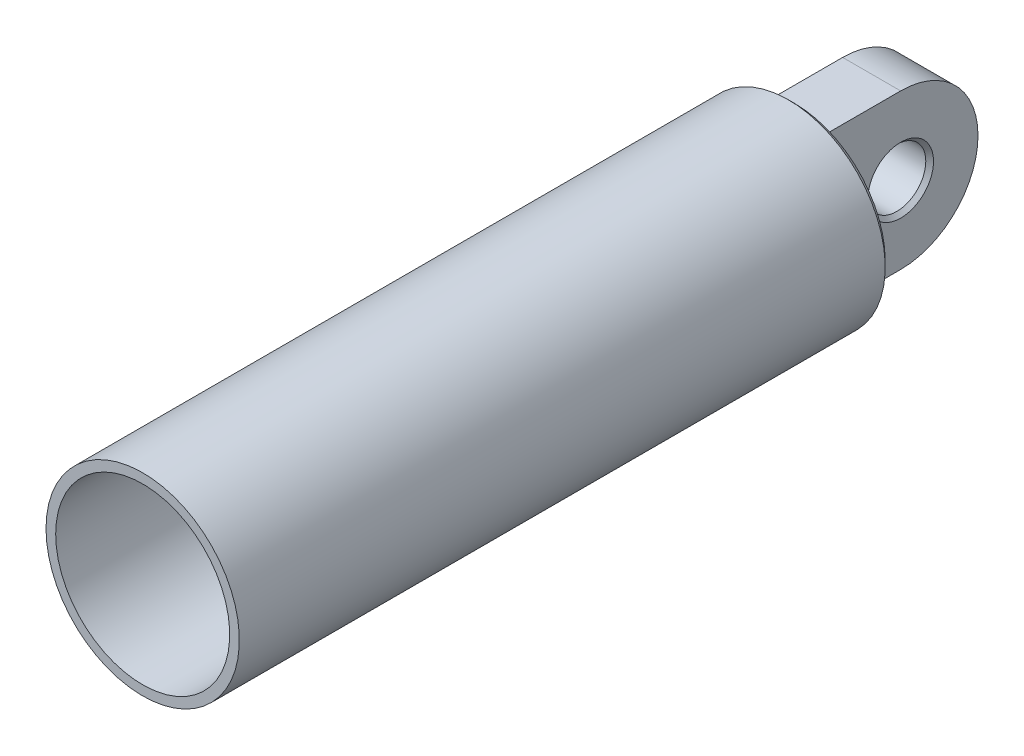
ISO-10303-21;
HEADER;
FILE_DESCRIPTION(('STEP AP214'),'2;1');
FILE_NAME('part.step','',(''),(''),'','','');
FILE_SCHEMA(('AUTOMOTIVE_DESIGN { 1 0 10303 214 1 1 1 1 }'));
ENDSEC;
DATA;
#1=APPLICATION_CONTEXT('core data for automotive mechanical design processes');
#2=APPLICATION_PROTOCOL_DEFINITION('international standard','automotive_design',2000,#1);
#3=PRODUCT_CONTEXT('',#1,'mechanical');
#4=PRODUCT('Part','Part','',(#3));
#5=PRODUCT_RELATED_PRODUCT_CATEGORY('part','',(#4));
#6=PRODUCT_DEFINITION_FORMATION('','',#4);
#7=PRODUCT_DEFINITION_CONTEXT('part definition',#1,'design');
#8=PRODUCT_DEFINITION('design','',#6,#7);
#9=PRODUCT_DEFINITION_SHAPE('','',#8);
#10=(LENGTH_UNIT() NAMED_UNIT(*) SI_UNIT(.MILLI.,.METRE.));
#11=(NAMED_UNIT(*) PLANE_ANGLE_UNIT() SI_UNIT($,.RADIAN.));
#12=(NAMED_UNIT(*) SI_UNIT($,.STERADIAN.) SOLID_ANGLE_UNIT());
#13=UNCERTAINTY_MEASURE_WITH_UNIT(LENGTH_MEASURE(1.E-05),#10,'distance_accuracy_value','');
#14=(GEOMETRIC_REPRESENTATION_CONTEXT(3) GLOBAL_UNCERTAINTY_ASSIGNED_CONTEXT((#13)) GLOBAL_UNIT_ASSIGNED_CONTEXT((#10,
#11,#12)) REPRESENTATION_CONTEXT('',''));
#15=CARTESIAN_POINT('',(0.,0.,0.));
#16=DIRECTION('',(0.,0.,1.));
#17=DIRECTION('',(1.,0.,0.));
#18=AXIS2_PLACEMENT_3D('',#15,#16,#17);
#19=CARTESIAN_POINT('',(0.,0.,-9.99999999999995));
#20=DIRECTION('',(0.,0.,-1.));
#21=DIRECTION('',(-1.,0.,0.));
#22=AXIS2_PLACEMENT_3D('',#19,#20,#21);
#23=PLANE('',#22);
#24=CARTESIAN_POINT('',(0.,0.,-9.99999999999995));
#25=DIRECTION('',(0.,0.,-1.));
#26=DIRECTION('',(-1.,0.,0.));
#27=AXIS2_PLACEMENT_3D('',#24,#25,#26);
#28=CIRCLE('',#27,47.);
#29=CARTESIAN_POINT('',(-47.,0.,-9.99999999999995));
#30=VERTEX_POINT('',#29);
#31=EDGE_CURVE('E130',#30,#30,#28,.T.);
#32=ORIENTED_EDGE('',*,*,#31,.T.);
#33=EDGE_LOOP('',(#32));
#34=FACE_BOUND('',#33,.T.);
#35=DIRECTION('',(-1.,0.,0.));
#36=VECTOR('',#35,1.);
#37=CARTESIAN_POINT('',(14.9999999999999,-40.,-10.0000000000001));
#38=LINE('',#37,#36);
#39=CARTESIAN_POINT('',(14.9999999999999,-40.,-10.0000000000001));
#40=VERTEX_POINT('',#39);
#41=CARTESIAN_POINT('',(-15.,-40.,-9.99999999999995));
#42=VERTEX_POINT('',#41);
#43=EDGE_CURVE('E91',#40,#42,#38,.T.);
#44=ORIENTED_EDGE('',*,*,#43,.F.);
#45=DIRECTION('',(0.,-1.,0.));
#46=VECTOR('',#45,1.);
#47=CARTESIAN_POINT('',(14.9999999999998,40.,-9.99999999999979));
#48=LINE('',#47,#46);
#49=CARTESIAN_POINT('',(14.9999999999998,40.,-9.99999999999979));
#50=VERTEX_POINT('',#49);
#51=EDGE_CURVE('E101',#50,#40,#48,.T.);
#52=ORIENTED_EDGE('',*,*,#51,.F.);
#53=DIRECTION('',(1.,0.,0.));
#54=VECTOR('',#53,1.);
#55=CARTESIAN_POINT('',(14.9999999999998,40.,-9.99999999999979));
#56=LINE('',#55,#54);
#57=CARTESIAN_POINT('',(-15.0000000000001,40.,-9.99999999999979));
#58=VERTEX_POINT('',#57);
#59=EDGE_CURVE('E113',#58,#50,#56,.T.);
#60=ORIENTED_EDGE('',*,*,#59,.F.);
#61=DIRECTION('',(0.,1.,0.));
#62=VECTOR('',#61,1.);
#63=CARTESIAN_POINT('',(-15.0000000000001,40.,-9.99999999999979));
#64=LINE('',#63,#62);
#65=EDGE_CURVE('E111',#42,#58,#64,.T.);
#66=ORIENTED_EDGE('',*,*,#65,.F.);
#67=EDGE_LOOP('',(#44,#52,#60,#66));
#68=FACE_BOUND('',#67,.T.);
#69=ADVANCED_FACE('F42',(#34,#68),#23,.T.);
#70=CARTESIAN_POINT('',(0.,0.,327.));
#71=DIRECTION('',(0.,0.,1.));
#72=DIRECTION('',(1.,0.,0.));
#73=AXIS2_PLACEMENT_3D('',#70,#71,#72);
#74=PLANE('',#73);
#75=CARTESIAN_POINT('',(0.,0.,327.));
#76=DIRECTION('',(0.,0.,1.));
#77=DIRECTION('',(1.,0.,0.));
#78=AXIS2_PLACEMENT_3D('',#75,#76,#77);
#79=CIRCLE('',#78,50.);
#80=CARTESIAN_POINT('',(-50.,0.,327.));
#81=VERTEX_POINT('',#80);
#82=EDGE_CURVE('E127',#81,#81,#79,.T.);
#83=ORIENTED_EDGE('',*,*,#82,.T.);
#84=EDGE_LOOP('',(#83));
#85=FACE_BOUND('',#84,.T.);
#86=CARTESIAN_POINT('',(0.,0.,327.));
#87=DIRECTION('',(0.,0.,1.));
#88=DIRECTION('',(1.,0.,0.));
#89=AXIS2_PLACEMENT_3D('',#86,#87,#88);
#90=CIRCLE('',#89,45.);
#91=CARTESIAN_POINT('',(-45.,0.,327.));
#92=VERTEX_POINT('',#91);
#93=EDGE_CURVE('E124',#92,#92,#90,.T.);
#94=ORIENTED_EDGE('',*,*,#93,.F.);
#95=EDGE_LOOP('',(#94));
#96=FACE_BOUND('',#95,.T.);
#97=ADVANCED_FACE('F186',(#85,#96),#74,.T.);
#98=CARTESIAN_POINT('',(0.,0.,327.));
#99=DIRECTION('',(0.,0.,-1.));
#100=DIRECTION('',(-1.,0.,0.));
#101=AXIS2_PLACEMENT_3D('',#98,#99,#100);
#102=CYLINDRICAL_SURFACE('',#101,50.);
#103=CARTESIAN_POINT('',(0.,0.,-7.00000000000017));
#104=DIRECTION('',(0.,0.,-1.));
#105=DIRECTION('',(-1.,0.,0.));
#106=AXIS2_PLACEMENT_3D('',#103,#104,#105);
#107=CIRCLE('',#106,50.);
#108=CARTESIAN_POINT('',(-50.,0.,-7.00000000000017));
#109=VERTEX_POINT('',#108);
#110=EDGE_CURVE('E133',#109,#109,#107,.F.);
#111=CARTESIAN_POINT('',(-50.,0.,-7.00000000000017));
#112=CARTESIAN_POINT('',(-50.,0.,-3.52083333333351));
#113=CARTESIAN_POINT('',(-50.,0.,-0.0416666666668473));
#114=CARTESIAN_POINT('',(-50.,0.,6.9166666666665));
#115=CARTESIAN_POINT('',(-50.,0.,10.3958333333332));
#116=CARTESIAN_POINT('',(-50.,0.,17.3541666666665));
#117=CARTESIAN_POINT('',(-50.,0.,20.8333333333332));
#118=CARTESIAN_POINT('',(-50.,0.,27.7916666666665));
#119=CARTESIAN_POINT('',(-50.,0.,31.2708333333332));
#120=CARTESIAN_POINT('',(-50.,0.,38.2291666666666));
#121=CARTESIAN_POINT('',(-50.,0.,41.7083333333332));
#122=CARTESIAN_POINT('',(-50.,0.,48.6666666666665));
#123=CARTESIAN_POINT('',(-50.,0.,52.1458333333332));
#124=CARTESIAN_POINT('',(-50.,0.,59.1041666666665));
#125=CARTESIAN_POINT('',(-50.,0.,62.5833333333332));
#126=CARTESIAN_POINT('',(-50.,0.,69.5416666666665));
#127=CARTESIAN_POINT('',(-50.,0.,73.0208333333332));
#128=CARTESIAN_POINT('',(-50.,0.,79.9791666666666));
#129=CARTESIAN_POINT('',(-50.,0.,83.4583333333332));
#130=CARTESIAN_POINT('',(-50.,0.,90.4166666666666));
#131=CARTESIAN_POINT('',(-50.,0.,93.8958333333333));
#132=CARTESIAN_POINT('',(-50.,0.,100.854166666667));
#133=CARTESIAN_POINT('',(-50.,0.,104.333333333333));
#134=CARTESIAN_POINT('',(-50.,0.,111.291666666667));
#135=CARTESIAN_POINT('',(-50.,0.,114.770833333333));
#136=CARTESIAN_POINT('',(-50.,0.,121.729166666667));
#137=CARTESIAN_POINT('',(-50.,0.,125.208333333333));
#138=CARTESIAN_POINT('',(-50.,0.,132.166666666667));
#139=CARTESIAN_POINT('',(-50.,0.,135.645833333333));
#140=CARTESIAN_POINT('',(-50.,0.,142.604166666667));
#141=CARTESIAN_POINT('',(-50.,0.,146.083333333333));
#142=CARTESIAN_POINT('',(-50.,0.,153.041666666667));
#143=CARTESIAN_POINT('',(-50.,0.,156.520833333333));
#144=CARTESIAN_POINT('',(-50.,0.,163.479166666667));
#145=CARTESIAN_POINT('',(-50.,0.,166.958333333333));
#146=CARTESIAN_POINT('',(-50.,0.,173.916666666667));
#147=CARTESIAN_POINT('',(-50.,0.,177.395833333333));
#148=CARTESIAN_POINT('',(-50.,0.,184.354166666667));
#149=CARTESIAN_POINT('',(-50.,0.,187.833333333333));
#150=CARTESIAN_POINT('',(-50.,0.,194.791666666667));
#151=CARTESIAN_POINT('',(-50.,0.,198.270833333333));
#152=CARTESIAN_POINT('',(-50.,0.,205.229166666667));
#153=CARTESIAN_POINT('',(-50.,0.,208.708333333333));
#154=CARTESIAN_POINT('',(-50.,0.,215.666666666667));
#155=CARTESIAN_POINT('',(-50.,0.,219.145833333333));
#156=CARTESIAN_POINT('',(-50.,0.,226.104166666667));
#157=CARTESIAN_POINT('',(-50.,0.,229.583333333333));
#158=CARTESIAN_POINT('',(-50.,0.,236.541666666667));
#159=CARTESIAN_POINT('',(-50.,0.,240.020833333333));
#160=CARTESIAN_POINT('',(-50.,0.,246.979166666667));
#161=CARTESIAN_POINT('',(-50.,0.,250.458333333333));
#162=CARTESIAN_POINT('',(-50.,0.,257.416666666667));
#163=CARTESIAN_POINT('',(-50.,0.,260.895833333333));
#164=CARTESIAN_POINT('',(-50.,0.,267.854166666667));
#165=CARTESIAN_POINT('',(-50.,0.,271.333333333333));
#166=CARTESIAN_POINT('',(-50.,0.,278.291666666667));
#167=CARTESIAN_POINT('',(-50.,0.,281.770833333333));
#168=CARTESIAN_POINT('',(-50.,0.,288.729166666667));
#169=CARTESIAN_POINT('',(-50.,0.,292.208333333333));
#170=CARTESIAN_POINT('',(-50.,0.,299.166666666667));
#171=CARTESIAN_POINT('',(-50.,0.,302.645833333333));
#172=CARTESIAN_POINT('',(-50.,0.,309.604166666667));
#173=CARTESIAN_POINT('',(-50.,0.,313.083333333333));
#174=CARTESIAN_POINT('',(-50.,0.,320.041666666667));
#175=CARTESIAN_POINT('',(-50.,0.,323.520833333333));
#176=CARTESIAN_POINT('',(-50.,0.,327.));
#177=B_SPLINE_CURVE_WITH_KNOTS('',3,(#111,#112,#113,#114,#115,#116,#117,#118,#119,#120,#121,
#122,#123,#124,#125,#126,#127,#128,#129,#130,#131,#132,#133,#134,#135,#136,#137,#138,#139,#140,
#141,#142,#143,#144,#145,#146,#147,#148,#149,#150,#151,#152,#153,#154,#155,#156,#157,#158,#159,
#160,#161,#162,#163,#164,#165,#166,#167,#168,#169,#170,#171,#172,#173,#174,#175,#176),
.UNSPECIFIED.,.F.,.F.,(4,2,2,2,2,2,2,2,2,2,2,2,2,2,2,2,2,2,2,2,2,2,2,2,2,2,2,2,2,2,2,2,4),(0.,
10.4375,20.875,31.3125,41.7500000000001,52.1875000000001,62.625,73.0625,83.5000000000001,
93.9375000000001,104.375,114.8125,125.25,135.6875,146.125,156.5625,167.,177.4375,187.875,
198.3125,208.75,219.1875,229.625,240.0625,250.5,260.9375,271.375,281.8125,292.25,302.6875,
313.125,323.5625,334.),.UNSPECIFIED.);
#178=EDGE_CURVE('BSEAM44',#109,#81,#177,.T.);
#179=ORIENTED_EDGE('',*,*,#110,.T.);
#180=ORIENTED_EDGE('',*,*,#82,.F.);
#181=ORIENTED_EDGE('',*,*,#178,.T.);
#182=ORIENTED_EDGE('',*,*,#178,.F.);
#183=EDGE_LOOP('',(#179,#181,#180,#182));
#184=FACE_BOUND('',#183,.T.);
#185=ADVANCED_FACE('F44',(#184),#102,.T.);
#186=CARTESIAN_POINT('',(0.,0.,327.));
#187=DIRECTION('',(0.,0.,-1.));
#188=DIRECTION('',(-1.,0.,0.));
#189=AXIS2_PLACEMENT_3D('',#186,#187,#188);
#190=CYLINDRICAL_SURFACE('',#189,45.);
#191=CARTESIAN_POINT('',(0.,0.,0.));
#192=DIRECTION('',(0.,0.,1.));
#193=DIRECTION('',(1.,0.,0.));
#194=AXIS2_PLACEMENT_3D('',#191,#192,#193);
#195=CIRCLE('',#194,45.);
#196=CARTESIAN_POINT('',(-45.,0.,0.));
#197=VERTEX_POINT('',#196);
#198=EDGE_CURVE('E97',#197,#197,#195,.T.);
#199=CARTESIAN_POINT('',(-45.,0.,327.));
#200=CARTESIAN_POINT('',(-45.,0.,323.59375));
#201=CARTESIAN_POINT('',(-45.,0.,320.1875));
#202=CARTESIAN_POINT('',(-45.,0.,313.375));
#203=CARTESIAN_POINT('',(-45.,0.,309.96875));
#204=CARTESIAN_POINT('',(-45.,0.,303.15625));
#205=CARTESIAN_POINT('',(-45.,0.,299.75));
#206=CARTESIAN_POINT('',(-45.,0.,292.9375));
#207=CARTESIAN_POINT('',(-45.,0.,289.53125));
#208=CARTESIAN_POINT('',(-45.,0.,282.71875));
#209=CARTESIAN_POINT('',(-45.,0.,279.3125));
#210=CARTESIAN_POINT('',(-45.,0.,272.5));
#211=CARTESIAN_POINT('',(-45.,0.,269.09375));
#212=CARTESIAN_POINT('',(-45.,0.,262.28125));
#213=CARTESIAN_POINT('',(-45.,0.,258.875));
#214=CARTESIAN_POINT('',(-45.,0.,252.0625));
#215=CARTESIAN_POINT('',(-45.,0.,248.65625));
#216=CARTESIAN_POINT('',(-45.,0.,241.84375));
#217=CARTESIAN_POINT('',(-45.,0.,238.4375));
#218=CARTESIAN_POINT('',(-45.,0.,231.625));
#219=CARTESIAN_POINT('',(-45.,0.,228.21875));
#220=CARTESIAN_POINT('',(-45.,0.,221.40625));
#221=CARTESIAN_POINT('',(-45.,0.,218.));
#222=CARTESIAN_POINT('',(-45.,0.,211.1875));
#223=CARTESIAN_POINT('',(-45.,0.,207.78125));
#224=CARTESIAN_POINT('',(-45.,0.,200.96875));
#225=CARTESIAN_POINT('',(-45.,0.,197.5625));
#226=CARTESIAN_POINT('',(-45.,0.,190.75));
#227=CARTESIAN_POINT('',(-45.,0.,187.34375));
#228=CARTESIAN_POINT('',(-45.,0.,180.53125));
#229=CARTESIAN_POINT('',(-45.,0.,177.125));
#230=CARTESIAN_POINT('',(-45.,0.,170.3125));
#231=CARTESIAN_POINT('',(-45.,0.,166.90625));
#232=CARTESIAN_POINT('',(-45.,0.,160.09375));
#233=CARTESIAN_POINT('',(-45.,0.,156.6875));
#234=CARTESIAN_POINT('',(-45.,0.,149.875));
#235=CARTESIAN_POINT('',(-45.,0.,146.46875));
#236=CARTESIAN_POINT('',(-45.,0.,139.65625));
#237=CARTESIAN_POINT('',(-45.,0.,136.25));
#238=CARTESIAN_POINT('',(-45.,0.,129.4375));
#239=CARTESIAN_POINT('',(-45.,0.,126.03125));
#240=CARTESIAN_POINT('',(-45.,0.,119.21875));
#241=CARTESIAN_POINT('',(-45.,0.,115.8125));
#242=CARTESIAN_POINT('',(-45.,0.,109.));
#243=CARTESIAN_POINT('',(-45.,0.,105.59375));
#244=CARTESIAN_POINT('',(-45.,0.,98.78125));
#245=CARTESIAN_POINT('',(-45.,0.,95.375));
#246=CARTESIAN_POINT('',(-45.,0.,88.5625));
#247=CARTESIAN_POINT('',(-45.,0.,85.15625));
#248=CARTESIAN_POINT('',(-45.,0.,78.34375));
#249=CARTESIAN_POINT('',(-45.,0.,74.9375));
#250=CARTESIAN_POINT('',(-45.,0.,68.125));
#251=CARTESIAN_POINT('',(-45.,0.,64.71875));
#252=CARTESIAN_POINT('',(-45.,0.,57.90625));
#253=CARTESIAN_POINT('',(-45.,0.,54.5));
#254=CARTESIAN_POINT('',(-45.,0.,47.6875));
#255=CARTESIAN_POINT('',(-45.,0.,44.28125));
#256=CARTESIAN_POINT('',(-45.,0.,37.4687499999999));
#257=CARTESIAN_POINT('',(-45.,0.,34.0624999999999));
#258=CARTESIAN_POINT('',(-45.,0.,27.2499999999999));
#259=CARTESIAN_POINT('',(-45.,0.,23.8437499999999));
#260=CARTESIAN_POINT('',(-45.,0.,17.0312499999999));
#261=CARTESIAN_POINT('',(-45.,0.,13.6249999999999));
#262=CARTESIAN_POINT('',(-45.,0.,6.81249999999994));
#263=CARTESIAN_POINT('',(-45.,0.,3.40624999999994));
#264=CARTESIAN_POINT('',(-45.,0.,0.));
#265=B_SPLINE_CURVE_WITH_KNOTS('',3,(#199,#200,#201,#202,#203,#204,#205,#206,#207,#208,#209,
#210,#211,#212,#213,#214,#215,#216,#217,#218,#219,#220,#221,#222,#223,#224,#225,#226,#227,#228,
#229,#230,#231,#232,#233,#234,#235,#236,#237,#238,#239,#240,#241,#242,#243,#244,#245,#246,#247,
#248,#249,#250,#251,#252,#253,#254,#255,#256,#257,#258,#259,#260,#261,#262,#263,#264),
.UNSPECIFIED.,.F.,.F.,(4,2,2,2,2,2,2,2,2,2,2,2,2,2,2,2,2,2,2,2,2,2,2,2,2,2,2,2,2,2,2,2,4),(0.,
10.2187500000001,20.4375000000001,30.65625,40.875,51.09375,61.3125,71.53125,81.75,91.96875,
102.1875,112.40625,122.625,132.84375,143.0625,153.28125,163.5,173.71875,183.9375,194.15625,
204.375,214.59375,224.8125,235.03125,245.25,255.46875,265.6875,275.90625,286.125,296.34375,
306.5625,316.78125,327.),.UNSPECIFIED.);
#266=EDGE_CURVE('BSEAM197',#92,#197,#265,.T.);
#267=ORIENTED_EDGE('',*,*,#93,.T.);
#268=ORIENTED_EDGE('',*,*,#198,.F.);
#269=ORIENTED_EDGE('',*,*,#266,.T.);
#270=ORIENTED_EDGE('',*,*,#266,.F.);
#271=EDGE_LOOP('',(#267,#269,#268,#270));
#272=FACE_BOUND('',#271,.T.);
#273=ADVANCED_FACE('F197',(#272),#190,.F.);
#274=CARTESIAN_POINT('',(0.,0.,0.));
#275=DIRECTION('',(0.,0.,-1.));
#276=DIRECTION('',(-1.,0.,0.));
#277=AXIS2_PLACEMENT_3D('',#274,#275,#276);
#278=PLANE('',#277);
#279=ORIENTED_EDGE('',*,*,#198,.T.);
#280=EDGE_LOOP('',(#279));
#281=FACE_BOUND('',#280,.T.);
#282=ADVANCED_FACE('F195',(#281),#278,.F.);
#283=CARTESIAN_POINT('',(0.,0.,-9.99999999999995));
#284=DIRECTION('',(0.,0.,1.));
#285=DIRECTION('',(1.,0.,0.));
#286=AXIS2_PLACEMENT_3D('',#283,#284,#285);
#287=CONICAL_SURFACE('',#286,47.,0.785398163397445);
#288=ORIENTED_EDGE('',*,*,#110,.F.);
#289=EDGE_LOOP('',(#288));
#290=FACE_BOUND('',#289,.T.);
#291=ORIENTED_EDGE('',*,*,#31,.F.);
#292=EDGE_LOOP('',(#291));
#293=FACE_BOUND('',#292,.T.);
#294=ADVANCED_FACE('F204',(#290,#293),#287,.T.);
#295=CARTESIAN_POINT('',(14.9999999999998,40.,-89.9999999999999));
#296=DIRECTION('',(-1.,0.,0.));
#297=DIRECTION('',(0.,-1.,0.));
#298=AXIS2_PLACEMENT_3D('',#295,#296,#297);
#299=PLANE('',#298);
#300=CARTESIAN_POINT('',(15.,0.,-50.));
#301=DIRECTION('',(-1.,0.,0.));
#302=DIRECTION('',(0.,-1.,0.));
#303=AXIS2_PLACEMENT_3D('',#300,#301,#302);
#304=CIRCLE('',#303,17.);
#305=CARTESIAN_POINT('',(15.,-17.,-50.));
#306=VERTEX_POINT('',#305);
#307=EDGE_CURVE('E12',#306,#306,#304,.T.);
#308=ORIENTED_EDGE('',*,*,#307,.T.);
#309=EDGE_LOOP('',(#308));
#310=FACE_BOUND('',#309,.T.);
#311=CARTESIAN_POINT('',(15.,0.,-50.));
#312=DIRECTION('',(-1.,0.,0.));
#313=DIRECTION('',(0.,-1.,0.));
#314=AXIS2_PLACEMENT_3D('',#311,#312,#313);
#315=CIRCLE('',#314,40.);
#316=CARTESIAN_POINT('',(14.9999999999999,-40.,-50.0000000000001));
#317=VERTEX_POINT('',#316);
#318=CARTESIAN_POINT('',(15.,0.,-90.));
#319=VERTEX_POINT('',#318);
#320=EDGE_CURVE('E136',#317,#319,#315,.F.);
#321=ORIENTED_EDGE('',*,*,#320,.T.);
#322=CARTESIAN_POINT('',(15.,0.,-50.));
#323=DIRECTION('',(-1.,0.,0.));
#324=DIRECTION('',(0.,-1.,0.));
#325=AXIS2_PLACEMENT_3D('',#322,#323,#324);
#326=CIRCLE('',#325,40.);
#327=CARTESIAN_POINT('',(14.9999999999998,40.,-49.9999999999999));
#328=VERTEX_POINT('',#327);
#329=EDGE_CURVE('E138',#319,#328,#326,.F.);
#330=ORIENTED_EDGE('',*,*,#329,.T.);
#331=DIRECTION('',(0.,0.,1.));
#332=VECTOR('',#331,1.);
#333=CARTESIAN_POINT('',(14.9999999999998,40.,-89.9999999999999));
#334=LINE('',#333,#332);
#335=EDGE_CURVE('E104',#328,#50,#334,.T.);
#336=ORIENTED_EDGE('',*,*,#335,.T.);
#337=ORIENTED_EDGE('',*,*,#51,.T.);
#338=DIRECTION('',(0.,0.,1.));
#339=VECTOR('',#338,1.);
#340=CARTESIAN_POINT('',(14.9999999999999,-40.,-90.0000000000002));
#341=LINE('',#340,#339);
#342=EDGE_CURVE('E87',#317,#40,#341,.T.);
#343=ORIENTED_EDGE('',*,*,#342,.F.);
#344=EDGE_LOOP('',(#321,#330,#336,#337,#343));
#345=FACE_BOUND('',#344,.T.);
#346=ADVANCED_FACE('F102',(#310,#345),#299,.F.);
#347=CARTESIAN_POINT('',(14.9999999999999,-40.,-90.0000000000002));
#348=DIRECTION('',(0.,1.,0.));
#349=DIRECTION('',(0.,0.,1.));
#350=AXIS2_PLACEMENT_3D('',#347,#348,#349);
#351=PLANE('',#350);
#352=DIRECTION('',(0.,0.,1.));
#353=VECTOR('',#352,1.);
#354=CARTESIAN_POINT('',(-15.,-40.,-90.0000000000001));
#355=LINE('',#354,#353);
#356=CARTESIAN_POINT('',(-15.,-40.,-50.0000000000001));
#357=VERTEX_POINT('',#356);
#358=EDGE_CURVE('E98',#357,#42,#355,.T.);
#359=ORIENTED_EDGE('',*,*,#358,.F.);
#360=DIRECTION('',(-1.,0.,0.));
#361=VECTOR('',#360,1.);
#362=CARTESIAN_POINT('',(14.9999999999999,-40.,-50.0000000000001));
#363=LINE('',#362,#361);
#364=EDGE_CURVE('E94',#357,#317,#363,.F.);
#365=ORIENTED_EDGE('',*,*,#364,.T.);
#366=ORIENTED_EDGE('',*,*,#342,.T.);
#367=ORIENTED_EDGE('',*,*,#43,.T.);
#368=EDGE_LOOP('',(#359,#365,#366,#367));
#369=FACE_BOUND('',#368,.T.);
#370=ADVANCED_FACE('F89',(#369),#351,.F.);
#371=CARTESIAN_POINT('',(-15.0000000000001,40.,-89.9999999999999));
#372=DIRECTION('',(1.,0.,0.));
#373=DIRECTION('',(0.,1.,0.));
#374=AXIS2_PLACEMENT_3D('',#371,#372,#373);
#375=PLANE('',#374);
#376=CARTESIAN_POINT('',(-15.,0.,-50.));
#377=DIRECTION('',(1.,0.,0.));
#378=DIRECTION('',(0.,1.,0.));
#379=AXIS2_PLACEMENT_3D('',#376,#377,#378);
#380=CIRCLE('',#379,17.);
#381=CARTESIAN_POINT('',(-15.,17.,-50.));
#382=VERTEX_POINT('',#381);
#383=EDGE_CURVE('E146',#382,#382,#380,.T.);
#384=ORIENTED_EDGE('',*,*,#383,.T.);
#385=EDGE_LOOP('',(#384));
#386=FACE_BOUND('',#385,.T.);
#387=DIRECTION('',(0.,0.,1.));
#388=VECTOR('',#387,1.);
#389=CARTESIAN_POINT('',(-15.0000000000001,40.,-89.9999999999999));
#390=LINE('',#389,#388);
#391=CARTESIAN_POINT('',(-15.0000000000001,40.,-49.9999999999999));
#392=VERTEX_POINT('',#391);
#393=EDGE_CURVE('E119',#392,#58,#390,.T.);
#394=ORIENTED_EDGE('',*,*,#393,.F.);
#395=CARTESIAN_POINT('',(-15.,0.,-50.));
#396=DIRECTION('',(1.,0.,0.));
#397=DIRECTION('',(0.,1.,0.));
#398=AXIS2_PLACEMENT_3D('',#395,#396,#397);
#399=CIRCLE('',#398,40.);
#400=CARTESIAN_POINT('',(-15.,0.,-89.9999999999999));
#401=VERTEX_POINT('',#400);
#402=EDGE_CURVE('E62',#392,#401,#399,.F.);
#403=ORIENTED_EDGE('',*,*,#402,.T.);
#404=CARTESIAN_POINT('',(-15.,0.,-50.));
#405=DIRECTION('',(1.,0.,0.));
#406=DIRECTION('',(0.,1.,0.));
#407=AXIS2_PLACEMENT_3D('',#404,#405,#406);
#408=CIRCLE('',#407,40.);
#409=EDGE_CURVE('E57',#401,#357,#408,.F.);
#410=ORIENTED_EDGE('',*,*,#409,.T.);
#411=ORIENTED_EDGE('',*,*,#358,.T.);
#412=ORIENTED_EDGE('',*,*,#65,.T.);
#413=EDGE_LOOP('',(#394,#403,#410,#411,#412));
#414=FACE_BOUND('',#413,.T.);
#415=ADVANCED_FACE('F164',(#386,#414),#375,.F.);
#416=CARTESIAN_POINT('',(14.9999999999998,40.,-89.9999999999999));
#417=DIRECTION('',(0.,-1.,0.));
#418=DIRECTION('',(1.,0.,0.));
#419=AXIS2_PLACEMENT_3D('',#416,#417,#418);
#420=PLANE('',#419);
#421=ORIENTED_EDGE('',*,*,#335,.F.);
#422=DIRECTION('',(1.,0.,0.));
#423=VECTOR('',#422,1.);
#424=CARTESIAN_POINT('',(-15.0000000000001,40.,-49.9999999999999));
#425=LINE('',#424,#423);
#426=EDGE_CURVE('E140',#328,#392,#425,.F.);
#427=ORIENTED_EDGE('',*,*,#426,.T.);
#428=ORIENTED_EDGE('',*,*,#393,.T.);
#429=ORIENTED_EDGE('',*,*,#59,.T.);
#430=EDGE_LOOP('',(#421,#427,#428,#429));
#431=FACE_BOUND('',#430,.T.);
#432=ADVANCED_FACE('F166',(#431),#420,.F.);
#433=CARTESIAN_POINT('',(15.,0.,-50.));
#434=DIRECTION('',(1.,0.,0.));
#435=DIRECTION('',(0.,0.,-1.));
#436=AXIS2_PLACEMENT_3D('',#433,#434,#435);
#437=CYLINDRICAL_SURFACE('',#436,40.);
#438=ORIENTED_EDGE('',*,*,#364,.F.);
#439=ORIENTED_EDGE('',*,*,#409,.F.);
#440=DIRECTION('',(-1.,0.,0.));
#441=VECTOR('',#440,1.);
#442=CARTESIAN_POINT('',(-15.,0.,-89.9999999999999));
#443=LINE('',#442,#441);
#444=EDGE_CURVE('E108',#319,#401,#443,.T.);
#445=ORIENTED_EDGE('',*,*,#444,.F.);
#446=ORIENTED_EDGE('',*,*,#320,.F.);
#447=EDGE_LOOP('',(#438,#439,#445,#446));
#448=FACE_BOUND('',#447,.T.);
#449=ADVANCED_FACE('F176',(#448),#437,.T.);
#450=CARTESIAN_POINT('',(15.,0.,-50.));
#451=DIRECTION('',(-1.,0.,0.));
#452=DIRECTION('',(0.,-1.,0.));
#453=AXIS2_PLACEMENT_3D('',#450,#451,#452);
#454=CYLINDRICAL_SURFACE('',#453,40.);
#455=ORIENTED_EDGE('',*,*,#402,.F.);
#456=ORIENTED_EDGE('',*,*,#426,.F.);
#457=ORIENTED_EDGE('',*,*,#329,.F.);
#458=ORIENTED_EDGE('',*,*,#444,.T.);
#459=EDGE_LOOP('',(#455,#456,#457,#458));
#460=FACE_BOUND('',#459,.T.);
#461=ADVANCED_FACE('F172',(#460),#454,.T.);
#462=CARTESIAN_POINT('',(-50.,0.,-50.));
#463=DIRECTION('',(1.,0.,0.));
#464=DIRECTION('',(0.,1.,0.));
#465=AXIS2_PLACEMENT_3D('',#462,#463,#464);
#466=CYLINDRICAL_SURFACE('',#465,15.);
#467=CARTESIAN_POINT('',(-13.,0.,-50.));
#468=DIRECTION('',(1.,0.,0.));
#469=DIRECTION('',(0.,1.,0.));
#470=AXIS2_PLACEMENT_3D('',#467,#468,#469);
#471=CIRCLE('',#470,15.);
#472=CARTESIAN_POINT('',(-13.,15.,-50.));
#473=VERTEX_POINT('',#472);
#474=EDGE_CURVE('E50',#473,#473,#471,.F.);
#475=ORIENTED_EDGE('',*,*,#474,.T.);
#476=EDGE_LOOP('',(#475));
#477=FACE_BOUND('',#476,.T.);
#478=CARTESIAN_POINT('',(13.,0.,-50.));
#479=DIRECTION('',(-1.,0.,0.));
#480=DIRECTION('',(0.,-1.,0.));
#481=AXIS2_PLACEMENT_3D('',#478,#479,#480);
#482=CIRCLE('',#481,15.);
#483=CARTESIAN_POINT('',(13.,-15.,-50.));
#484=VERTEX_POINT('',#483);
#485=EDGE_CURVE('E149',#484,#484,#482,.F.);
#486=ORIENTED_EDGE('',*,*,#485,.T.);
#487=EDGE_LOOP('',(#486));
#488=FACE_BOUND('',#487,.T.);
#489=ADVANCED_FACE('F154',(#477,#488),#466,.F.);
#490=CARTESIAN_POINT('',(-15.,0.,-50.));
#491=DIRECTION('',(-1.,0.,0.));
#492=DIRECTION('',(0.,-1.,0.));
#493=AXIS2_PLACEMENT_3D('',#490,#491,#492);
#494=CONICAL_SURFACE('',#493,17.,0.785398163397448);
#495=ORIENTED_EDGE('',*,*,#474,.F.);
#496=EDGE_LOOP('',(#495));
#497=FACE_BOUND('',#496,.T.);
#498=ORIENTED_EDGE('',*,*,#383,.F.);
#499=EDGE_LOOP('',(#498));
#500=FACE_BOUND('',#499,.T.);
#501=ADVANCED_FACE('F157',(#497,#500),#494,.F.);
#502=CARTESIAN_POINT('',(13.,0.,-50.));
#503=DIRECTION('',(1.,0.,0.));
#504=DIRECTION('',(0.,1.,0.));
#505=AXIS2_PLACEMENT_3D('',#502,#503,#504);
#506=CONICAL_SURFACE('',#505,15.,0.785398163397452);
#507=ORIENTED_EDGE('',*,*,#307,.F.);
#508=EDGE_LOOP('',(#507));
#509=FACE_BOUND('',#508,.T.);
#510=ORIENTED_EDGE('',*,*,#485,.F.);
#511=EDGE_LOOP('',(#510));
#512=FACE_BOUND('',#511,.T.);
#513=ADVANCED_FACE('F160',(#509,#512),#506,.F.);
#514=CLOSED_SHELL('',(#69,#97,#185,#273,#282,#294,#346,#370,#415,#432,#449,#461,#489,#501,#513));
#515=MANIFOLD_SOLID_BREP('B2',#514);
#516=ADVANCED_BREP_SHAPE_REPRESENTATION('',(#18,#515),#14);
#517=SHAPE_DEFINITION_REPRESENTATION(#9,#516);
ENDSEC;
END-ISO-10303-21;
